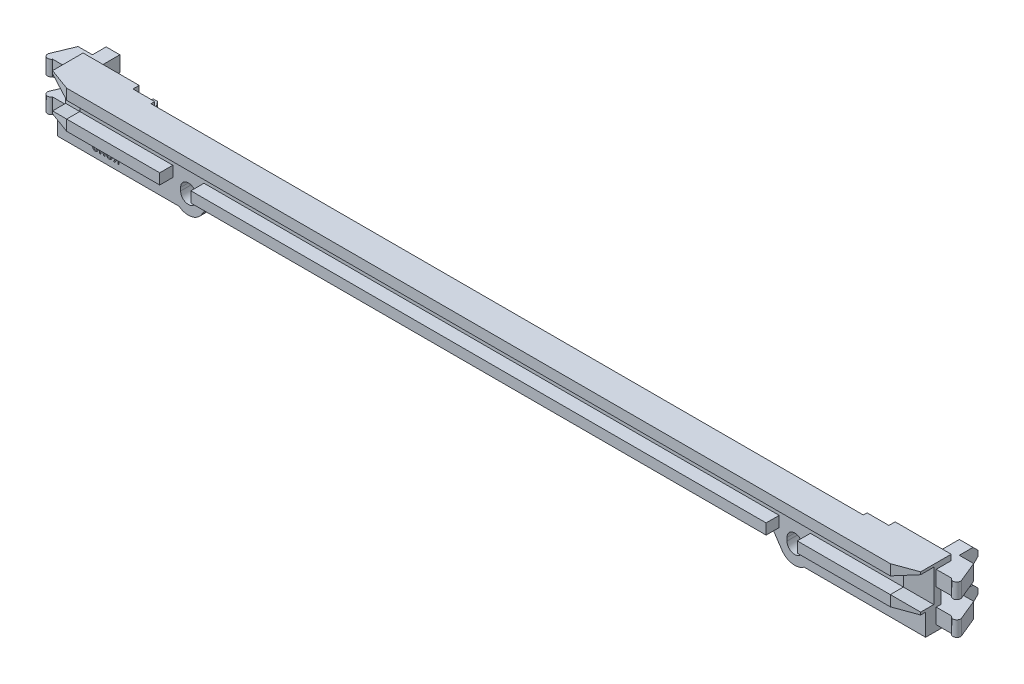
from build123d import *
from OCP.BRepFilletAPI import BRepFilletAPI_MakeChamfer

# Parameters (mm, degrees)
EXTRUDE_1_DEPTH     = 2.5
SKETCH_3_W          = 139.3
SKETCH_3_H          = 1.7
SKETCH_3_W_2        = 18.5
SKETCH_3_W_3        = 92.3
EXTRUDE_2_DEPTH     = 2.1
SKETCH_4_W          = 15.216666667
SKETCH_4_H          = 3.1
SKETCH_4_W_2        = 15.216666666
CUT_EXTRUDE_1_DEPTH = 1.6
EXTRUDE_3_DEPTH     = 2.45
SKETCH_6_W          = 12.5
SKETCH_6_H          = 1.5
SKETCH_6_H_2        = 1.4
EXTRUDE_4_DEPTH     = 0.6
SKETCH_7_W          = 9
SKETCH_7_H          = 1.5
SKETCH_7_H_2        = 1.4
EXTRUDE_5_DEPTH     = 1
CHAMFER_1_SIZE      = 1.3
CHAMFER_1_SIZE2     = 3.571720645
CHAMFER_2_SIZE      = 0.8
EXTRUDE_6_DEPTH     = 1.5
CUT_EXTRUDE_2_DEPTH = 0.2


with BuildPart() as part:
    # Sketch 1 → Extrude 1 (new body)
    with BuildSketch(Plane.XY):
        with BuildLine():
            Line((-43.042304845, -1.25), (43.042304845, -1.25))
            ThreePointArc((43.042304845, -1.25), (44.459347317, -1.60576275), (45.540302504, -2.588672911))
            Line((45.540302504, -2.588672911), (46.568335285, -4.134439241))
            ThreePointArc((46.568335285, -4.134439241), (48.226547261, -5.213876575), (50.15, -4.75))
            Line((50.15, -4.75), (69.65, -4.75))
            Line((69.65, -4.75), (69.65, 4.75))
            Line((69.65, 4.75), (-69.65, 4.75))
            Line((-69.65, 4.75), (-69.65, -4.75))
            Line((-69.65, -4.75), (-50.15, -4.75))
            ThreePointArc((-50.15, -4.75), (-48.226547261, -5.213876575), (-46.568335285, -4.134439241))
            Line((-46.568335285, -4.134439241), (-45.540302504, -2.588672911))
            ThreePointArc((-45.540302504, -2.588672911), (-44.459347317, -1.60576275), (-43.042304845, -1.25))
        make_face()
        with BuildLine():
            Line((-47.4, -2), (-47.4, -2.5))
            ThreePointArc((-47.4, -2.5), (-48.65, -3.75), (-49.9, -2.5))
            Line((-49.9, -2.5), (-49.9, -2))
            ThreePointArc((-49.9, -2), (-48.65, -0.75), (-47.4, -2))
        make_face(mode=Mode.SUBTRACT)
        with BuildLine():
            Line((47.4, -2), (47.4, -2.5))
            ThreePointArc((47.4, -2.5), (48.65, -3.75), (49.9, -2.5))
            Line((49.9, -2.5), (49.9, -2))
            ThreePointArc((49.9, -2), (48.65, -0.75), (47.4, -2))
        make_face(mode=Mode.SUBTRACT)
    extrude(amount=EXTRUDE_1_DEPTH)

    # Sketch 3 → Extrude 2 (add)
    with BuildSketch(Plane.XY.offset(2.5)):
        with Locations((0, 3.9)):
            Rectangle(SKETCH_3_W, SKETCH_3_H)
        with Locations((-60.4, -0.4)):
            Rectangle(SKETCH_3_W_2, SKETCH_3_H)
        with Locations((60.4, -0.4)):
            Rectangle(SKETCH_3_W_2, SKETCH_3_H)
        with Locations((0, -0.4)):
            Rectangle(SKETCH_3_W_3, SKETCH_3_H)
    extrude(amount=EXTRUDE_2_DEPTH)

    # Sketch 4 → Cut-Extrude 1 (cut)
    with BuildSketch(Plane(origin=(0, 0, 0), x_dir=(-1, 0, 0), z_dir=(0, 0, -1))):
        with Locations((-40.541666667, 1.7)):
            Rectangle(SKETCH_4_W, SKETCH_4_H)
        with Locations((-24.325, 1.7)):
            Rectangle(SKETCH_4_W_2, SKETCH_4_H)
        with Locations((-8.108333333, 1.7)):
            Rectangle(SKETCH_4_W, SKETCH_4_H)
        with Locations((8.108333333, 1.7)):
            Rectangle(SKETCH_4_W, SKETCH_4_H)
        with Locations((24.325, 1.7)):
            Rectangle(SKETCH_4_W_2, SKETCH_4_H)
        with Locations((40.541666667, 1.7)):
            Rectangle(SKETCH_4_W, SKETCH_4_H)
        with BuildLine():
            Line((50.9, -3.35), (67.45, -3.35))
            Line((67.45, -3.35), (67.45, 3.25))
            Line((67.45, 3.25), (49.15, 3.25))
            Line((49.15, 3.25), (49.15, 0.193741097))
            ThreePointArc((49.15, 0.193741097), (50.40890591, -0.59687848), (50.9, -2))
            Line((50.9, -2), (50.9, -3.35))
        make_face()
        with BuildLine():
            Line((-50.9, -3.35), (-67.45, -3.35))
            Line((-67.45, -3.35), (-67.45, 3.25))
            Line((-67.45, 3.25), (-49.15, 3.25))
            Line((-49.15, 3.25), (-49.15, 0.193741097))
            ThreePointArc((-49.15, 0.193741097), (-50.40890591, -0.59687848), (-50.9, -2))
            Line((-50.9, -2), (-50.9, -3.35))
        make_face()
    extrude(amount=-CUT_EXTRUDE_1_DEPTH, mode=Mode.SUBTRACT)

    # Sketch 5 → Extrude 3 (add)
    with BuildSketch(Plane(origin=(0, 3.85, 0), x_dir=(1, 0, 0), z_dir=(0, 1, 0))):
        with BuildLine():
            Line((67.35, 0), (69.65, 0))
            Line((69.65, 0), (69.65, -0.8))
            Line((69.65, -0.8), (72.130384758, -0.8))
            ThreePointArc((72.130384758, -0.8), (72.915351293, -1.038134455), (73.204346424, -0.270435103))
            Line((73.204346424, -0.270435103), (71.85, 3))
            Line((71.85, 3), (69.55, 3))
            Line((69.55, 3), (69.55, 6))
            Line((69.55, 6), (67.35, 6))
            Line((67.35, 6), (67.35, 0))
        make_face()
        with BuildLine():
            Line((-67.35, 6), (-67.35, 0))
            Line((-67.35, 0), (-69.65, 0))
            Line((-69.65, 0), (-69.65, -0.8))
            Line((-69.65, -0.8), (-72.130384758, -0.8))
            ThreePointArc((-72.130384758, -0.8), (-72.915351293, -1.038134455), (-73.204346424, -0.270435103))
            Line((-73.204346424, -0.270435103), (-71.85, 3))
            Line((-71.85, 3), (-69.55, 3))
            Line((-69.55, 3), (-69.55, 6))
            Line((-69.55, 6), (-67.35, 6))
        make_face()
    extrude_3 = extrude(amount=-EXTRUDE_3_DEPTH)

    # Mirror 1: Extrude 3 across plane
    add(extrude_3.mirror(Plane.ZX))

    # Sketch 6 → Extrude 4 (add)
    with BuildSketch(Plane(origin=(0, 0, 0), x_dir=(-1, 0, 0), z_dir=(0, 0, -1))):
        with Locations((63.4, 4)):
            Rectangle(SKETCH_6_W, SKETCH_6_H)
        with Locations((63.4, -4.05)):
            Rectangle(SKETCH_6_W, SKETCH_6_H_2)
        with Locations((-63.4, 4)):
            Rectangle(SKETCH_6_W, SKETCH_6_H)
        with Locations((-63.4, -4.05)):
            Rectangle(SKETCH_6_W, SKETCH_6_H_2)
    extrude(amount=EXTRUDE_4_DEPTH)

    # Sketch 7 → Extrude 5 (add)
    with BuildSketch(Plane(origin=(0, 0, -0.6), x_dir=(-1, 0, 0), z_dir=(0, 0, -1))):
        with Locations((-65.15, 4)):
            Rectangle(SKETCH_7_W, SKETCH_7_H)
        with Locations((-65.15, -4.05)):
            Rectangle(SKETCH_7_W, SKETCH_7_H_2)
        with Locations((65.15, 4)):
            Rectangle(SKETCH_7_W, SKETCH_7_H)
        with Locations((65.15, -4.05)):
            Rectangle(SKETCH_7_W, SKETCH_7_H_2)
    extrude(amount=EXTRUDE_5_DEPTH)

    # Chamfer 1: one chamfer whose edges measure the first distance from different faces: ONE call of the kernel's chamfer builder (chamfer() names one face for all edges)
    chamfer_1_edges_1 = [part.edges().sort_by_distance(p)[0] for p in [
        (69.65, 3.9, 4.6),
        (69.65, -0.4, 4.6),
        (69.65, 3.05, 3.55),
        (69.65, 1.75, 2.5),
        (69.65, 0.45, 3.55),
    ]]
    chamfer_1_side_1 = [part.faces().sort_by_distance(p)[0] for p in [
        (69.65, 0.418592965, 1.7139866),
    ]]
    chamfer_1_edges_2 = [part.edges().sort_by_distance(p)[0] for p in [
        (-69.65, -0.4, 4.6),
        (-69.65, 0.45, 3.55),
        (-69.65, 1.75, 2.5),
        (-69.65, 3.05, 3.55),
        (-69.65, 3.9, 4.6),
    ]]
    chamfer_1_side_2 = [part.faces().sort_by_distance(p)[0] for p in [
        (-69.65, 0.418592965, 1.7139866),
    ]]
    chamfer_1 = BRepFilletAPI_MakeChamfer(part.part.solid().wrapped)
    for e in chamfer_1_edges_1:
        chamfer_1.Add(CHAMFER_1_SIZE, CHAMFER_1_SIZE2, e.wrapped, chamfer_1_side_1[0].wrapped)  # the first distance lies on this face
    for e in chamfer_1_edges_2:
        chamfer_1.Add(CHAMFER_1_SIZE, CHAMFER_1_SIZE2, e.wrapped, chamfer_1_side_2[0].wrapped)  # the first distance lies on this face
    add(Compound.cast(chamfer_1.Shape()), mode=Mode.REPLACE)

    # Chamfer 2
    chamfer_2_edges = [part.edges().sort_by_distance(p)[0] for p in [
        (68.45, 1.4, -6),
        (67.35, 2.625, -6),
        (68.45, 3.85, -6),
        (-68.45, 1.4, -6),
        (-67.35, 2.625, -6),
        (-68.45, 3.85, -6),
        (67.35, -2.625, -6),
        (68.45, -3.85, -6),
        (68.45, -1.4, -6),
        (-68.45, -3.85, -6),
        (-67.35, -2.625, -6),
        (-68.45, -1.4, -6),
    ]]
    chamfer(chamfer_2_edges, length=CHAMFER_2_SIZE)

    # Sketch 9 → Extrude 6 (add, symmetric)
    with BuildSketch(Plane(origin=(0, 0, 0), x_dir=(1, 0, 0), z_dir=(0, 1, 0))):
        Polygon((-60.9, 4.1), (-60.9, -1.6), (-58.9, -1.6), (-59.589745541, 3.307794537), (-60.2, 4.1), align=None)
        Polygon((60.2, 4.1), (59.589745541, 3.307794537), (58.9, -1.6), (60.9, -1.6), (60.9, 4.1), align=None)
    extrude(amount=EXTRUDE_6_DEPTH, both=True)

    # Sketch 10 → Cut-Extrude 2 (cut)
    # profile 1 of 4: a face of its own
    with BuildSketch(Plane.XY.offset(2.5)):
        with BuildLine():
            add(Edge.make_bspline(
                [(-64.062280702, -3.048245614), (-64.061924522, -3.015099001), (-64.061237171, -2.951133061), (-64.05550418, -2.858834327), (-64.045523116, -2.773794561), (-64.031723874, -2.695953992), (-64.014105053, -2.625270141), (-63.992363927, -2.56184921), (-63.967019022, -2.505454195), (-63.9366888, -2.456510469), (-63.903076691, -2.414008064), (-63.866292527, -2.377064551), (-63.826295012, -2.345760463), (-63.783064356, -2.320161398), (-63.73670486, -2.300514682), (-63.687261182, -2.286598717), (-63.634598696, -2.277954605), (-63.598376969, -2.276870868), (-63.579824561, -2.276315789)],
                knots=[0, 0, 0, 0, 1.545771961, 2.983012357, 4.310477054, 5.53694469, 6.667573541, 7.704171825, 8.660118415, 9.544545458, 10.382225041, 11.182194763, 11.970229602, 12.744599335, 13.518524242, 14.311480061, 15.135156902, 16, 16, 16, 16], degree=3))
            add(Edge.make_bspline(
                [(-63.579824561, -2.276315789), (-63.561271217, -2.276866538), (-63.525047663, -2.277941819), (-63.472192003, -2.286680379), (-63.422314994, -2.300520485), (-63.375360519, -2.320066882), (-63.331689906, -2.345838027), (-63.291076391, -2.377127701), (-63.253330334, -2.413956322), (-63.218750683, -2.456464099), (-63.187423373, -2.505388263), (-63.161109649, -2.561799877), (-63.138316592, -2.625175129), (-63.120056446, -2.695900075), (-63.106008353, -2.773787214), (-63.095699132, -2.858823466), (-63.089549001, -2.951121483), (-63.08892158, -3.015097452), (-63.088596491, -3.048245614)],
                knots=[0, 0, 0, 0, 0.860780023, 1.68058719, 2.479491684, 3.259041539, 4.034105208, 4.82638745, 5.633332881, 6.476525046, 7.364812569, 8.322660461, 9.359409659, 10.487238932, 11.708844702, 13.030675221, 14.461490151, 16, 16, 16, 16], degree=3))
            add(Edge.make_bspline(
                [(-63.088596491, -3.048245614), (-63.088919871, -3.081393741), (-63.08954294, -3.14526158), (-63.095692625, -3.237345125), (-63.106024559, -3.322051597), (-63.119957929, -3.3994278), (-63.138370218, -3.46947173), (-63.161112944, -3.532100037), (-63.187337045, -3.587823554), (-63.218765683, -3.63583649), (-63.253345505, -3.677373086), (-63.291097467, -3.713236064), (-63.331802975, -3.743526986), (-63.37545781, -3.768592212), (-63.422322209, -3.787894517), (-63.472246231, -3.801253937), (-63.525031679, -3.810209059), (-63.56126754, -3.810998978), (-63.579824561, -3.811403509)],
                knots=[0, 0, 0, 0, 1.548230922, 2.98303917, 4.308200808, 5.532550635, 6.652834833, 7.686623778, 8.641401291, 9.522543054, 10.35935634, 11.160886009, 11.949022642, 12.72391454, 13.50644669, 14.309045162, 15.13403228, 16, 16, 16, 16], degree=3))
            add(Edge.make_bspline(
                [(-63.579824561, -3.811403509), (-63.598380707, -3.810994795), (-63.634614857, -3.810196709), (-63.68720608, -3.801334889), (-63.736697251, -3.787900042), (-63.782968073, -3.768499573), (-63.826179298, -3.743604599), (-63.866269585, -3.713299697), (-63.903062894, -3.677321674), (-63.936675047, -3.635790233), (-63.967104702, -3.587754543), (-63.992360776, -3.532050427), (-64.014053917, -3.469376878), (-64.031819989, -3.399372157), (-64.045507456, -3.322044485), (-64.055510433, -3.237334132), (-64.061242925, -3.145249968), (-64.061926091, -3.081392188), (-64.062280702, -3.048245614)],
                knots=[0, 0, 0, 0, 0.870119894, 1.699062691, 2.495710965, 3.272607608, 4.046805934, 4.830589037, 5.624963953, 6.456101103, 7.333244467, 8.286074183, 9.319696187, 10.442778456, 11.672084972, 13.002989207, 14.444345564, 16, 16, 16, 16], degree=3))
        make_face()
        with BuildLine():
            add(Edge.make_bspline(
                [(-63.851754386, -3.048245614), (-63.851496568, -3.077597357), (-63.851003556, -3.133725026), (-63.847547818, -3.213924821), (-63.841576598, -3.28625356), (-63.832840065, -3.35065551), (-63.822202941, -3.407323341), (-63.808651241, -3.45592553), (-63.793123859, -3.496865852), (-63.774216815, -3.530056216), (-63.753349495, -3.557193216), (-63.732129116, -3.580679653), (-63.709495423, -3.600514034), (-63.685570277, -3.616412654), (-63.660884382, -3.629439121), (-63.634733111, -3.638076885), (-63.607707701, -3.644005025), (-63.58917037, -3.644491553), (-63.579824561, -3.644736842)],
                knots=[0, 0, 0, 0, 1.935009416, 3.700208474, 5.290966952, 6.717666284, 7.983429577, 9.088666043, 10.040575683, 10.86236036, 11.596304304, 12.29363804, 12.946461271, 13.574167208, 14.184039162, 14.780089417, 15.384968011, 16, 16, 16, 16], degree=3))
            add(Edge.make_bspline(
                [(-63.579824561, -3.644736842), (-63.570479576, -3.644485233), (-63.551837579, -3.643983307), (-63.524598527, -3.638073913), (-63.498115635, -3.629456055), (-63.473059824, -3.61633162), (-63.448527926, -3.60055661), (-63.425243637, -3.580612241), (-63.403047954, -3.557243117), (-63.381206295, -3.530122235), (-63.361292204, -3.496954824), (-63.344787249, -3.455987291), (-63.33019069, -3.407413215), (-63.318929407, -3.350698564), (-63.309951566, -3.28626065), (-63.303649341, -3.213933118), (-63.29978116, -3.133733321), (-63.299348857, -3.077598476), (-63.299122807, -3.048245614)],
                knots=[0, 0, 0, 0, 0.611201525, 1.219265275, 1.81832141, 2.430716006, 3.066343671, 3.725874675, 4.433422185, 5.175826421, 6.003240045, 6.957248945, 8.061566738, 9.322244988, 10.74103478, 12.322506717, 14.077041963, 16, 16, 16, 16], degree=3))
            add(Edge.make_bspline(
                [(-63.299122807, -3.048245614), (-63.299351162, -3.018892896), (-63.299788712, -2.962650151), (-63.303643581, -2.882232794), (-63.309984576, -2.809478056), (-63.318894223, -2.74459831), (-63.330232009, -2.687358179), (-63.344868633, -2.638167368), (-63.361276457, -2.596307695), (-63.381337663, -2.562181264), (-63.402836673, -2.533807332), (-63.425241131, -2.50972186), (-63.448619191, -2.489203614), (-63.472850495, -2.47228677), (-63.498125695, -2.458990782), (-63.524529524, -2.449859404), (-63.551858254, -2.444170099), (-63.570484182, -2.443379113), (-63.579824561, -2.442982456)],
                knots=[0, 0, 0, 0, 1.905496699, 3.651122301, 5.225236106, 6.645066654, 7.901182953, 9.008941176, 9.973772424, 10.81182905, 11.569731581, 12.281072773, 12.943777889, 13.585412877, 14.195455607, 14.791357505, 15.393899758, 16, 16, 16, 16], degree=3))
            add(Edge.make_bspline(
                [(-63.579824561, -2.442982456), (-63.589165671, -2.44337305), (-63.607686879, -2.444147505), (-63.634802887, -2.449857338), (-63.660873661, -2.459007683), (-63.685784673, -2.472208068), (-63.709401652, -2.489244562), (-63.73213411, -2.509654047), (-63.753556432, -2.533866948), (-63.77408503, -2.562240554), (-63.793138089, -2.59639566), (-63.808573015, -2.638225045), (-63.822164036, -2.687446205), (-63.832873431, -2.744641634), (-63.841544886, -2.809484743), (-63.847553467, -2.882241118), (-63.85099648, -2.962658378), (-63.851494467, -3.018893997), (-63.851754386, -3.048245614)],
                knots=[0, 0, 0, 0, 0.609805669, 1.209100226, 1.80197336, 2.409477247, 3.043460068, 3.699626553, 4.401016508, 5.150948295, 5.983648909, 6.946538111, 8.055194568, 9.316215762, 10.743762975, 12.326884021, 14.082853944, 16, 16, 16, 16], degree=3))
        make_face(mode=Mode.SUBTRACT)
    # profile 2 of 4: a face of its own
    with BuildSketch(Plane.XY.offset(2.5)):
        Polygon((-62.904385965, -2.293859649), (-62.685087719, -2.293859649), (-62.202631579, -3.381578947), (-62.193859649, -3.381578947), (-62.193859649, -2.293859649), (-61.992105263, -2.293859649), (-61.992105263, -3.793859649), (-62.211403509, -3.793859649), (-62.693859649, -2.706140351), (-62.702631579, -2.706140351), (-62.702631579, -3.793859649), (-62.904385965, -3.793859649), align=None)
    # profile 3 of 4: a face of its own
    with BuildSketch(Plane.XY.offset(2.5)):
        with BuildLine():
            add(Edge.make_bspline(
                [(-61.816666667, -3.048245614), (-61.816310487, -3.015099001), (-61.815623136, -2.951133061), (-61.809890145, -2.858834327), (-61.799909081, -2.773794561), (-61.786109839, -2.695953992), (-61.768491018, -2.625270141), (-61.746749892, -2.56184921), (-61.721404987, -2.505454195), (-61.691074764, -2.456510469), (-61.657462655, -2.414008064), (-61.620678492, -2.377064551), (-61.580680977, -2.345760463), (-61.53745032, -2.320161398), (-61.491090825, -2.300514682), (-61.441647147, -2.286598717), (-61.388984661, -2.277954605), (-61.352762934, -2.276870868), (-61.334210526, -2.276315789)],
                knots=[0, 0, 0, 0, 1.545771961, 2.983012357, 4.310477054, 5.53694469, 6.667573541, 7.704171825, 8.660118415, 9.544545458, 10.382225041, 11.182194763, 11.970229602, 12.744599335, 13.518524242, 14.311480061, 15.135156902, 16, 16, 16, 16], degree=3))
            add(Edge.make_bspline(
                [(-61.334210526, -2.276315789), (-61.315657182, -2.276866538), (-61.279433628, -2.277941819), (-61.226577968, -2.286680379), (-61.176700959, -2.300520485), (-61.129746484, -2.320066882), (-61.086075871, -2.345838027), (-61.045462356, -2.377127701), (-61.007716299, -2.413956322), (-60.973136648, -2.456464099), (-60.941809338, -2.505388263), (-60.915495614, -2.561799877), (-60.892702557, -2.625175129), (-60.874442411, -2.695900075), (-60.860394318, -2.773787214), (-60.850085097, -2.858823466), (-60.843934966, -2.951121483), (-60.843307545, -3.015097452), (-60.842982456, -3.048245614)],
                knots=[0, 0, 0, 0, 0.860780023, 1.68058719, 2.479491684, 3.259041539, 4.034105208, 4.82638745, 5.633332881, 6.476525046, 7.364812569, 8.322660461, 9.359409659, 10.487238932, 11.708844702, 13.030675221, 14.461490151, 16, 16, 16, 16], degree=3))
            add(Edge.make_bspline(
                [(-60.842982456, -3.048245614), (-60.843305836, -3.081393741), (-60.843928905, -3.14526158), (-60.850078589, -3.237345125), (-60.860410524, -3.322051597), (-60.874343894, -3.3994278), (-60.892756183, -3.46947173), (-60.915498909, -3.532100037), (-60.94172301, -3.587823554), (-60.973151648, -3.63583649), (-61.00773147, -3.677373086), (-61.045483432, -3.713236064), (-61.08618894, -3.743526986), (-61.129843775, -3.768592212), (-61.176708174, -3.787894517), (-61.226632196, -3.801253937), (-61.279417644, -3.810209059), (-61.315653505, -3.810998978), (-61.334210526, -3.811403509)],
                knots=[0, 0, 0, 0, 1.548230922, 2.98303917, 4.308200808, 5.532550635, 6.652834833, 7.686623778, 8.641401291, 9.522543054, 10.35935634, 11.160886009, 11.949022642, 12.72391454, 13.50644669, 14.309045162, 15.13403228, 16, 16, 16, 16], degree=3))
            add(Edge.make_bspline(
                [(-61.334210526, -3.811403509), (-61.352766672, -3.810994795), (-61.389000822, -3.810196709), (-61.441592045, -3.801334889), (-61.491083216, -3.787900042), (-61.537354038, -3.768499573), (-61.580565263, -3.743604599), (-61.62065555, -3.713299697), (-61.657448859, -3.677321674), (-61.691061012, -3.635790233), (-61.721490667, -3.587754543), (-61.746746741, -3.532050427), (-61.768439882, -3.469376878), (-61.786205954, -3.399372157), (-61.79989342, -3.322044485), (-61.809896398, -3.237334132), (-61.81562889, -3.145249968), (-61.816312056, -3.081392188), (-61.816666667, -3.048245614)],
                knots=[0, 0, 0, 0, 0.870119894, 1.699062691, 2.495710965, 3.272607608, 4.046805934, 4.830589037, 5.624963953, 6.456101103, 7.333244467, 8.286074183, 9.319696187, 10.442778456, 11.672084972, 13.002989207, 14.444345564, 16, 16, 16, 16], degree=3))
        make_face()
        with BuildLine():
            add(Edge.make_bspline(
                [(-61.606140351, -3.048245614), (-61.605882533, -3.077597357), (-61.605389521, -3.133725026), (-61.601933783, -3.213924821), (-61.595962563, -3.28625356), (-61.58722603, -3.35065551), (-61.576588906, -3.407323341), (-61.563037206, -3.45592553), (-61.547509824, -3.496865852), (-61.52860278, -3.530056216), (-61.50773546, -3.557193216), (-61.486515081, -3.580679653), (-61.463881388, -3.600514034), (-61.439956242, -3.616412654), (-61.415270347, -3.629439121), (-61.389119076, -3.638076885), (-61.362093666, -3.644005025), (-61.343556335, -3.644491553), (-61.334210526, -3.644736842)],
                knots=[0, 0, 0, 0, 1.935009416, 3.700208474, 5.290966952, 6.717666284, 7.983429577, 9.088666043, 10.040575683, 10.86236036, 11.596304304, 12.29363804, 12.946461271, 13.574167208, 14.184039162, 14.780089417, 15.384968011, 16, 16, 16, 16], degree=3))
            add(Edge.make_bspline(
                [(-61.334210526, -3.644736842), (-61.324865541, -3.644485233), (-61.306223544, -3.643983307), (-61.278984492, -3.638073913), (-61.252501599, -3.629456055), (-61.227445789, -3.61633162), (-61.202913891, -3.60055661), (-61.179629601, -3.580612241), (-61.157433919, -3.557243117), (-61.13559226, -3.530122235), (-61.115678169, -3.496954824), (-61.099173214, -3.455987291), (-61.084576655, -3.407413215), (-61.073315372, -3.350698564), (-61.064337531, -3.28626065), (-61.058035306, -3.213933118), (-61.054167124, -3.133733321), (-61.053734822, -3.077598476), (-61.053508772, -3.048245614)],
                knots=[0, 0, 0, 0, 0.611201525, 1.219265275, 1.81832141, 2.430716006, 3.066343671, 3.725874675, 4.433422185, 5.175826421, 6.003240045, 6.957248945, 8.061566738, 9.322244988, 10.74103478, 12.322506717, 14.077041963, 16, 16, 16, 16], degree=3))
            add(Edge.make_bspline(
                [(-61.053508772, -3.048245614), (-61.053737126, -3.018892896), (-61.054174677, -2.962650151), (-61.058029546, -2.882232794), (-61.064370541, -2.809478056), (-61.073280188, -2.74459831), (-61.084617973, -2.687358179), (-61.099254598, -2.638167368), (-61.115662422, -2.596307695), (-61.135723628, -2.562181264), (-61.157222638, -2.533807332), (-61.179627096, -2.50972186), (-61.203005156, -2.489203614), (-61.22723646, -2.47228677), (-61.25251166, -2.458990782), (-61.278915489, -2.449859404), (-61.306244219, -2.444170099), (-61.324870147, -2.443379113), (-61.334210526, -2.442982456)],
                knots=[0, 0, 0, 0, 1.905496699, 3.651122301, 5.225236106, 6.645066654, 7.901182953, 9.008941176, 9.973772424, 10.81182905, 11.569731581, 12.281072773, 12.943777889, 13.585412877, 14.195455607, 14.791357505, 15.393899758, 16, 16, 16, 16], degree=3))
            add(Edge.make_bspline(
                [(-61.334210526, -2.442982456), (-61.343551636, -2.44337305), (-61.362072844, -2.444147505), (-61.389188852, -2.449857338), (-61.415259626, -2.459007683), (-61.440170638, -2.472208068), (-61.463787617, -2.489244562), (-61.486520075, -2.509654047), (-61.507942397, -2.533866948), (-61.528470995, -2.562240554), (-61.547524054, -2.59639566), (-61.56295898, -2.638225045), (-61.576550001, -2.687446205), (-61.587259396, -2.744641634), (-61.595930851, -2.809484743), (-61.601939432, -2.882241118), (-61.605382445, -2.962658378), (-61.605880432, -3.018893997), (-61.606140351, -3.048245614)],
                knots=[0, 0, 0, 0, 0.609805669, 1.209100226, 1.80197336, 2.409477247, 3.043460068, 3.699626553, 4.401016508, 5.150948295, 5.983648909, 6.946538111, 8.055194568, 9.316215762, 10.743762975, 12.326884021, 14.082853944, 16, 16, 16, 16], degree=3))
        make_face(mode=Mode.SUBTRACT)
    # profile 4 of 4: a face of its own
    with BuildSketch(Plane.XY.offset(2.5)):
        Polygon((-60.728947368, -2.293859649), (-60.500877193, -2.293859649), (-60.097368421, -3.039473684), (-59.957017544, -2.855263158), (-59.957017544, -2.293859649), (-59.755263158, -2.293859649), (-59.755263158, -3.793859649), (-59.957017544, -3.793859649), (-59.957017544, -3.144736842), (-60.457017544, -3.793859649), (-60.693859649, -3.793859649), (-60.228947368, -3.206140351), align=None)
    extrude(amount=-CUT_EXTRUDE_2_DEPTH, mode=Mode.SUBTRACT)


solid = part.part
